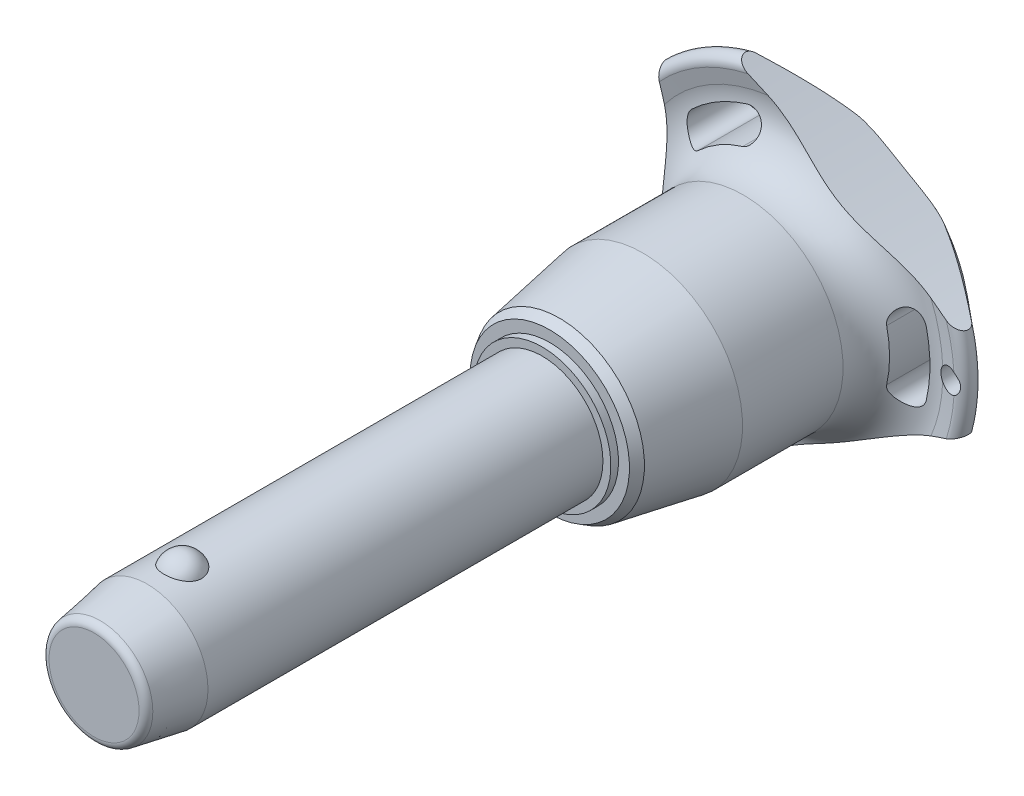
from build123d import *

# Parameters (mm, degrees)
SKETCH1_R           = 8
BOSS_EXTRUDE1_DEPTH = 45
SKETCH2_R           = 7
BOSS_EXTRUDE2_DEPTH = 39.7
BOSS_EXTRUDE3_START = 14
SKETCH1_2_R         = 8
BOSS_EXTRUDE3_DEPTH = 14
CHAMFER1_SIZE       = 7
CHAMFER1_SIZE2      = 1.234288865
FILLET1_R           = 1
SKETCH6_R           = 144.275
CUT_EXTRUDE1_DEPTH  = 92.145351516
CIRPATTERN1_COUNT   = 3
SKETCH7_R           = 1.5
CUT_EXTRUDE2_DEPTH  = 91.924898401


with BuildPart() as part:
    # Sketch1 → Boss-Extrude1 (new body)
    with BuildSketch(Plane.XY):
        Circle(SKETCH1_R)
    extrude(amount=-BOSS_EXTRUDE1_DEPTH)

    # Sketch2 → Boss-Extrude2 (add)
    with BuildSketch(Plane(origin=(0, 0, -45), x_dir=(-1, 0, 0), z_dir=(0, 0, -1))):
        Circle(SKETCH2_R)
    extrude(amount=BOSS_EXTRUDE2_DEPTH)

    # Sketch3 → Revolve1 (revolve)
    with BuildSketch(Plane(origin=(0, 0, 0), x_dir=(0, 0, -1), z_dir=(1, 0, 0))):
        with BuildLine():
            Line((-2.387467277, 9.5), (-2.387467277, 4.2))
            ThreePointArc((-2.387467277, 4.2), (0.262532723, 6.85), (-2.387467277, 9.5))
        make_face()
        with BuildLine():
            Line((-2.387467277, -4.2), (-2.387467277, -9.5))
            ThreePointArc((-2.387467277, -9.5), (0.262532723, -6.85), (-2.387467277, -4.2))
        make_face()
    revolve(axis=Axis((0, -4.2, 2.387467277), (0, 1, 0)))

    # Sketch1_2 → Boss-Extrude3 (add)
    with BuildSketch(Plane.XY.offset(BOSS_EXTRUDE3_START)):
        Circle(SKETCH1_2_R)
    extrude(amount=-BOSS_EXTRUDE3_DEPTH)

    # Chamfer1
    chamfer1_edges = [part.edges().sort_by_distance(p)[0] for p in [
        (-8, 0, 14),
    ]]
    chamfer1_side = [part.faces().sort_by_distance(p)[0] for p in [
        (-8, 0, -15.5),
    ]]
    chamfer(chamfer1_edges, length=CHAMFER1_SIZE, length2=CHAMFER1_SIZE2, reference=chamfer1_side[0])

    # Fillet1
    fillet1_edges = [part.edges().sort_by_distance(p)[0] for p in [
        (-6.765711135, 0, 14),
        (7, 0, -84.7),
    ]]
    fillet(fillet1_edges, radius=FILLET1_R)

    # Sketch4 → Revolve2 (revolve)
    with BuildSketch(Plane(origin=(0, 0, 0), x_dir=(0, 0, -1), z_dir=(1, 0, 0)), mode=Mode.PRIVATE) as revolve2_sk:
        Polygon((45, 0), (45, 9.044607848), (46, 9.044607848), (46, 10.490707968), (47.25235944, 11.213758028), (58.233333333, 13.15), (71.466666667, 13.15), (71.466666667, 0), align=None)
    revolve(revolve2_sk.sketch.rotate(Axis((0, 0, -71.466666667), (0, 0, 1)), 90), axis=Axis((0, 0, -71.466666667), (0, 0, 1)))

    # Sketch5 → Revolve3 (revolve)
    with BuildSketch(Plane(origin=(0, 0, 0), x_dir=(0, 0, -1), z_dir=(1, 0, 0)), mode=Mode.PRIVATE) as revolve3_sk:
        with BuildLine():
            Line((77.32877039, 20.428960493), (76.910912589, 22.344207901))
            ThreePointArc((76.910912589, 22.344207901), (77.554394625, 23.677136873), (79.002586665, 23.371345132))
            Line((79.002586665, 23.371345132), (84.141488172, 17.247040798))
            ThreePointArc((84.141488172, 17.247040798), (84.7, 15.584758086), (83.978803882, 13.986322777))
            ThreePointArc((83.978803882, 13.986322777), (79.617427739, 7.589034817), (78.083333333, 0))
            Line((78.083333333, 0), (71.466666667, 0))
            Line((71.466666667, 0), (71.466666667, 13.15))
            ThreePointArc((71.466666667, 13.15), (76.139661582, 15.38660811), (77.32877039, 20.428960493))
        make_face()
    revolve(revolve3_sk.sketch.rotate(Axis((0, 0, -78.083333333), (0, 0, 1)), 90), axis=Axis((0, 0, -78.083333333), (0, 0, 1)))

    # Sketch6 → Cut-Extrude1 (cut, through all)
    with BuildSketch(Plane.XY):
        with Locations((-159.975, 0)):
            Circle(SKETCH6_R)
        with BuildLine():
            ThreePointArc((18.131206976, -4.190753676), (18.60922037, 0), (18.131206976, 4.190753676))
            ThreePointArc((18.131206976, 4.190753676), (15.94840906, 5.553949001), (14.585213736, 3.371151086))
            ThreePointArc((14.585213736, 3.371151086), (14.969740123, 0), (14.585213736, -3.371151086))
            ThreePointArc((14.585213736, -3.371151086), (15.94840906, -5.553949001), (18.131206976, -4.190753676))
        make_face()
    cut_extrude1 = extrude(amount=-CUT_EXTRUDE1_DEPTH, mode=Mode.SUBTRACT)

    # CirPattern1: Cut-Extrude1 ×3 about axis
    cirpattern1_axis = Axis((0, 0, 0), (0, 0, 1))
    for i in range(1, CIRPATTERN1_COUNT):
        add(cut_extrude1.rotate(cirpattern1_axis, i * 360 / CIRPATTERN1_COUNT), mode=Mode.SUBTRACT)

    # Sketch7 → Cut-Extrude2 (cut, through all)
    with BuildSketch(Plane.XY):
        with Locations(Location((21.60922037, 0, 0), (0, 0, 297.620773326))):
            Circle(SKETCH7_R)
    extrude(amount=-CUT_EXTRUDE2_DEPTH, mode=Mode.SUBTRACT)


solid = part.part
